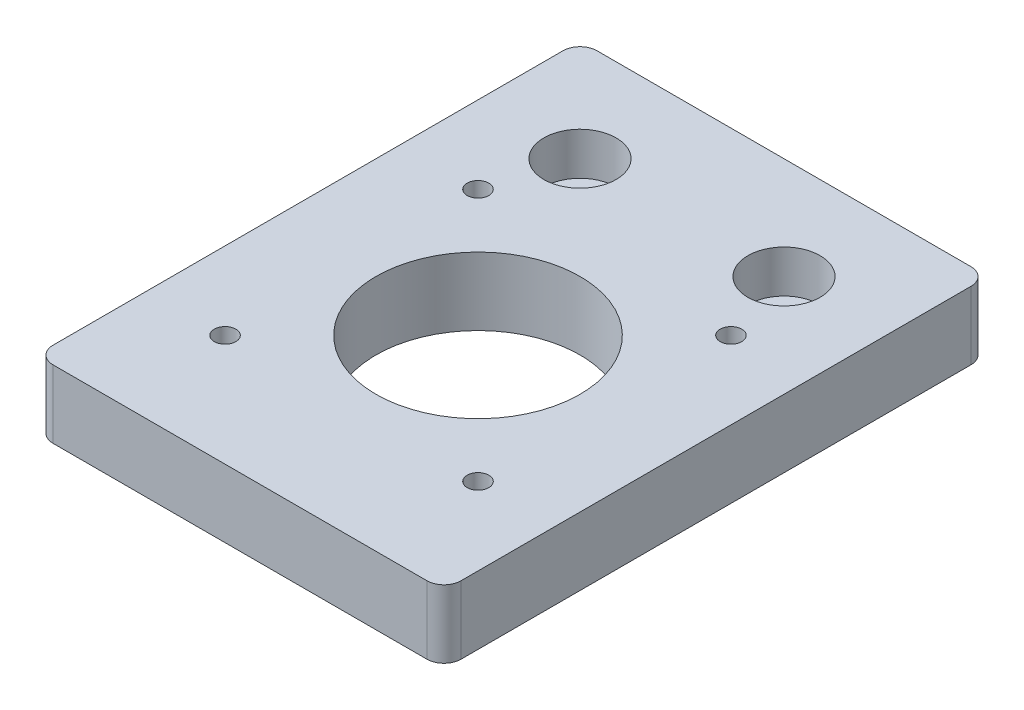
ISO-10303-21;
HEADER;
FILE_DESCRIPTION(('STEP AP214'),'2;1');
FILE_NAME('part.step','',(''),(''),'','','');
FILE_SCHEMA(('AUTOMOTIVE_DESIGN { 1 0 10303 214 1 1 1 1 }'));
ENDSEC;
DATA;
#1=APPLICATION_CONTEXT('core data for automotive mechanical design processes');
#2=APPLICATION_PROTOCOL_DEFINITION('international standard','automotive_design',2000,#1);
#3=PRODUCT_CONTEXT('',#1,'mechanical');
#4=PRODUCT('Part','Part','',(#3));
#5=PRODUCT_RELATED_PRODUCT_CATEGORY('part','',(#4));
#6=PRODUCT_DEFINITION_FORMATION('','',#4);
#7=PRODUCT_DEFINITION_CONTEXT('part definition',#1,'design');
#8=PRODUCT_DEFINITION('design','',#6,#7);
#9=PRODUCT_DEFINITION_SHAPE('','',#8);
#10=(LENGTH_UNIT() NAMED_UNIT(*) SI_UNIT(.MILLI.,.METRE.));
#11=(NAMED_UNIT(*) PLANE_ANGLE_UNIT() SI_UNIT($,.RADIAN.));
#12=(NAMED_UNIT(*) SI_UNIT($,.STERADIAN.) SOLID_ANGLE_UNIT());
#13=UNCERTAINTY_MEASURE_WITH_UNIT(LENGTH_MEASURE(1.E-05),#10,'distance_accuracy_value','');
#14=(GEOMETRIC_REPRESENTATION_CONTEXT(3) GLOBAL_UNCERTAINTY_ASSIGNED_CONTEXT((#13)) GLOBAL_UNIT_ASSIGNED_CONTEXT((#10,
#11,#12)) REPRESENTATION_CONTEXT('',''));
#15=CARTESIAN_POINT('',(0.,0.,0.));
#16=DIRECTION('',(0.,0.,1.));
#17=DIRECTION('',(1.,0.,0.));
#18=AXIS2_PLACEMENT_3D('',#15,#16,#17);
#19=CARTESIAN_POINT('',(0.,0.,-101.6));
#20=DIRECTION('',(0.,-1.,0.));
#21=DIRECTION('',(0.,0.,-1.));
#22=AXIS2_PLACEMENT_3D('',#19,#20,#21);
#23=PLANE('',#22);
#24=CARTESIAN_POINT('',(14.478,0.,-20.828));
#25=DIRECTION('',(0.,1.,0.));
#26=DIRECTION('',(0.,0.,1.));
#27=AXIS2_PLACEMENT_3D('',#24,#25,#26);
#28=CIRCLE('',#27,2.0193);
#29=CARTESIAN_POINT('',(14.478,0.,-18.8087));
#30=VERTEX_POINT('',#29);
#31=EDGE_CURVE('E216',#30,#30,#28,.T.);
#32=ORIENTED_EDGE('',*,*,#31,.T.);
#33=EDGE_LOOP('',(#32));
#34=FACE_BOUND('',#33,.T.);
#35=CARTESIAN_POINT('',(61.722,0.,-68.072));
#36=DIRECTION('',(0.,1.,0.));
#37=DIRECTION('',(0.,0.,1.));
#38=AXIS2_PLACEMENT_3D('',#35,#36,#37);
#39=CIRCLE('',#38,2.01929999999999);
#40=CARTESIAN_POINT('',(61.722,0.,-66.0527));
#41=VERTEX_POINT('',#40);
#42=EDGE_CURVE('E204',#41,#41,#39,.T.);
#43=ORIENTED_EDGE('',*,*,#42,.T.);
#44=EDGE_LOOP('',(#43));
#45=FACE_BOUND('',#44,.T.);
#46=CARTESIAN_POINT('',(19.05,0.,-82.55));
#47=DIRECTION('',(0.,1.,0.));
#48=DIRECTION('',(0.,0.,1.));
#49=AXIS2_PLACEMENT_3D('',#46,#47,#48);
#50=CIRCLE('',#49,4.1021);
#51=CARTESIAN_POINT('',(19.05,0.,-78.4479));
#52=VERTEX_POINT('',#51);
#53=EDGE_CURVE('E186',#52,#52,#50,.T.);
#54=ORIENTED_EDGE('',*,*,#53,.T.);
#55=EDGE_LOOP('',(#54));
#56=FACE_BOUND('',#55,.T.);
#57=CARTESIAN_POINT('',(38.1,0.,-44.45));
#58=DIRECTION('',(0.,1.,0.));
#59=DIRECTION('',(0.,0.,1.));
#60=AXIS2_PLACEMENT_3D('',#57,#58,#59);
#61=CIRCLE('',#60,19.0627);
#62=CARTESIAN_POINT('',(38.1,0.,-25.3873));
#63=VERTEX_POINT('',#62);
#64=EDGE_CURVE('E164',#63,#63,#61,.T.);
#65=ORIENTED_EDGE('',*,*,#64,.T.);
#66=EDGE_LOOP('',(#65));
#67=FACE_BOUND('',#66,.T.);
#68=DIRECTION('',(-1.,0.,0.));
#69=VECTOR('',#68,1.);
#70=CARTESIAN_POINT('',(0.,0.,-101.6));
#71=LINE('',#70,#69);
#72=CARTESIAN_POINT('',(73.025,0.,-101.6));
#73=VERTEX_POINT('',#72);
#74=CARTESIAN_POINT('',(3.175,0.,-101.6));
#75=VERTEX_POINT('',#74);
#76=EDGE_CURVE('E117',#73,#75,#71,.T.);
#77=ORIENTED_EDGE('',*,*,#76,.F.);
#78=CARTESIAN_POINT('',(73.025,0.,-98.425));
#79=DIRECTION('',(0.,-1.,0.));
#80=DIRECTION('',(0.,0.,-1.));
#81=AXIS2_PLACEMENT_3D('',#78,#79,#80);
#82=CIRCLE('',#81,3.175);
#83=CARTESIAN_POINT('',(76.2,0.,-98.425));
#84=VERTEX_POINT('',#83);
#85=EDGE_CURVE('E100',#73,#84,#82,.T.);
#86=ORIENTED_EDGE('',*,*,#85,.T.);
#87=DIRECTION('',(0.,0.,-1.));
#88=VECTOR('',#87,1.);
#89=CARTESIAN_POINT('',(76.2,0.,0.));
#90=LINE('',#89,#88);
#91=CARTESIAN_POINT('',(76.2,0.,-3.175));
#92=VERTEX_POINT('',#91);
#93=EDGE_CURVE('E127',#92,#84,#90,.T.);
#94=ORIENTED_EDGE('',*,*,#93,.F.);
#95=CARTESIAN_POINT('',(73.025,0.,-3.175));
#96=DIRECTION('',(0.,-1.,0.));
#97=DIRECTION('',(0.,0.,-1.));
#98=AXIS2_PLACEMENT_3D('',#95,#96,#97);
#99=CIRCLE('',#98,3.175);
#100=CARTESIAN_POINT('',(73.025,0.,0.));
#101=VERTEX_POINT('',#100);
#102=EDGE_CURVE('E121',#92,#101,#99,.T.);
#103=ORIENTED_EDGE('',*,*,#102,.T.);
#104=DIRECTION('',(1.,0.,0.));
#105=VECTOR('',#104,1.);
#106=CARTESIAN_POINT('',(0.,0.,0.));
#107=LINE('',#106,#105);
#108=CARTESIAN_POINT('',(3.175,0.,0.));
#109=VERTEX_POINT('',#108);
#110=EDGE_CURVE('E131',#109,#101,#107,.T.);
#111=ORIENTED_EDGE('',*,*,#110,.F.);
#112=CARTESIAN_POINT('',(3.175,0.,-3.175));
#113=DIRECTION('',(0.,-1.,0.));
#114=DIRECTION('',(0.,0.,-1.));
#115=AXIS2_PLACEMENT_3D('',#112,#113,#114);
#116=CIRCLE('',#115,3.175);
#117=CARTESIAN_POINT('',(0.,0.,-3.175));
#118=VERTEX_POINT('',#117);
#119=EDGE_CURVE('E137',#109,#118,#116,.T.);
#120=ORIENTED_EDGE('',*,*,#119,.T.);
#121=DIRECTION('',(0.,0.,1.));
#122=VECTOR('',#121,1.);
#123=CARTESIAN_POINT('',(0.,0.,0.));
#124=LINE('',#123,#122);
#125=CARTESIAN_POINT('',(0.,0.,-98.425));
#126=VERTEX_POINT('',#125);
#127=EDGE_CURVE('E159',#126,#118,#124,.T.);
#128=ORIENTED_EDGE('',*,*,#127,.F.);
#129=CARTESIAN_POINT('',(3.175,0.,-98.425));
#130=DIRECTION('',(0.,-1.,0.));
#131=DIRECTION('',(0.,0.,-1.));
#132=AXIS2_PLACEMENT_3D('',#129,#130,#131);
#133=CIRCLE('',#132,3.175);
#134=EDGE_CURVE('E111',#126,#75,#133,.T.);
#135=ORIENTED_EDGE('',*,*,#134,.T.);
#136=EDGE_LOOP('',(#77,#86,#94,#103,#111,#120,#128,#135));
#137=FACE_BOUND('',#136,.T.);
#138=CARTESIAN_POINT('',(57.15,0.,-82.55));
#139=DIRECTION('',(0.,1.,0.));
#140=DIRECTION('',(0.,0.,1.));
#141=AXIS2_PLACEMENT_3D('',#138,#139,#140);
#142=CIRCLE('',#141,4.1021);
#143=CARTESIAN_POINT('',(57.15,0.,-78.4479));
#144=VERTEX_POINT('',#143);
#145=EDGE_CURVE('E198',#144,#144,#142,.T.);
#146=ORIENTED_EDGE('',*,*,#145,.T.);
#147=EDGE_LOOP('',(#146));
#148=FACE_BOUND('',#147,.T.);
#149=CARTESIAN_POINT('',(14.478,0.,-68.072));
#150=DIRECTION('',(0.,1.,0.));
#151=DIRECTION('',(0.,0.,1.));
#152=AXIS2_PLACEMENT_3D('',#149,#150,#151);
#153=CIRCLE('',#152,2.0193);
#154=CARTESIAN_POINT('',(14.478,0.,-66.0527));
#155=VERTEX_POINT('',#154);
#156=EDGE_CURVE('E210',#155,#155,#153,.T.);
#157=ORIENTED_EDGE('',*,*,#156,.T.);
#158=EDGE_LOOP('',(#157));
#159=FACE_BOUND('',#158,.T.);
#160=CARTESIAN_POINT('',(61.722,0.,-20.828));
#161=DIRECTION('',(0.,1.,0.));
#162=DIRECTION('',(0.,0.,1.));
#163=AXIS2_PLACEMENT_3D('',#160,#161,#162);
#164=CIRCLE('',#163,2.0193);
#165=CARTESIAN_POINT('',(61.722,0.,-18.8087));
#166=VERTEX_POINT('',#165);
#167=EDGE_CURVE('E222',#166,#166,#164,.T.);
#168=ORIENTED_EDGE('',*,*,#167,.T.);
#169=EDGE_LOOP('',(#168));
#170=FACE_BOUND('',#169,.T.);
#171=ADVANCED_FACE('F34',(#34,#45,#56,#67,#137,#148,#159,#170),#23,.T.);
#172=CARTESIAN_POINT('',(0.,12.7,0.));
#173=DIRECTION('',(1.,0.,0.));
#174=DIRECTION('',(0.,0.,-1.));
#175=AXIS2_PLACEMENT_3D('',#172,#173,#174);
#176=PLANE('',#175);
#177=DIRECTION('',(0.,0.,1.));
#178=VECTOR('',#177,1.);
#179=CARTESIAN_POINT('',(0.,12.7,0.));
#180=LINE('',#179,#178);
#181=CARTESIAN_POINT('',(0.,12.7,-98.425));
#182=VERTEX_POINT('',#181);
#183=CARTESIAN_POINT('',(0.,12.7,-3.175));
#184=VERTEX_POINT('',#183);
#185=EDGE_CURVE('E126',#182,#184,#180,.T.);
#186=ORIENTED_EDGE('',*,*,#185,.F.);
#187=DIRECTION('',(0.,-1.,0.));
#188=VECTOR('',#187,1.);
#189=CARTESIAN_POINT('',(0.,12.7,-98.425));
#190=LINE('',#189,#188);
#191=EDGE_CURVE('E152',#182,#126,#190,.T.);
#192=ORIENTED_EDGE('',*,*,#191,.T.);
#193=ORIENTED_EDGE('',*,*,#127,.T.);
#194=DIRECTION('',(0.,-1.,0.));
#195=VECTOR('',#194,1.);
#196=CARTESIAN_POINT('',(0.,12.7,-3.175));
#197=LINE('',#196,#195);
#198=EDGE_CURVE('E150',#118,#184,#197,.F.);
#199=ORIENTED_EDGE('',*,*,#198,.T.);
#200=EDGE_LOOP('',(#186,#192,#193,#199));
#201=FACE_BOUND('',#200,.T.);
#202=ADVANCED_FACE('F158',(#201),#176,.F.);
#203=CARTESIAN_POINT('',(0.,12.7,0.));
#204=DIRECTION('',(0.,0.,-1.));
#205=DIRECTION('',(-1.,0.,0.));
#206=AXIS2_PLACEMENT_3D('',#203,#204,#205);
#207=PLANE('',#206);
#208=DIRECTION('',(1.,0.,0.));
#209=VECTOR('',#208,1.);
#210=CARTESIAN_POINT('',(0.,12.7,0.));
#211=LINE('',#210,#209);
#212=CARTESIAN_POINT('',(3.175,12.7,0.));
#213=VERTEX_POINT('',#212);
#214=CARTESIAN_POINT('',(73.025,12.7,0.));
#215=VERTEX_POINT('',#214);
#216=EDGE_CURVE('E129',#213,#215,#211,.T.);
#217=ORIENTED_EDGE('',*,*,#216,.F.);
#218=DIRECTION('',(0.,-1.,0.));
#219=VECTOR('',#218,1.);
#220=CARTESIAN_POINT('',(3.175,12.7,0.));
#221=LINE('',#220,#219);
#222=EDGE_CURVE('E11',#213,#109,#221,.T.);
#223=ORIENTED_EDGE('',*,*,#222,.T.);
#224=ORIENTED_EDGE('',*,*,#110,.T.);
#225=DIRECTION('',(0.,-1.,0.));
#226=VECTOR('',#225,1.);
#227=CARTESIAN_POINT('',(73.025,12.7,0.));
#228=LINE('',#227,#226);
#229=EDGE_CURVE('E42',#101,#215,#228,.F.);
#230=ORIENTED_EDGE('',*,*,#229,.T.);
#231=EDGE_LOOP('',(#217,#223,#224,#230));
#232=FACE_BOUND('',#231,.T.);
#233=ADVANCED_FACE('F256',(#232),#207,.F.);
#234=CARTESIAN_POINT('',(76.2,12.7,0.));
#235=DIRECTION('',(-1.,0.,0.));
#236=DIRECTION('',(0.,0.,1.));
#237=AXIS2_PLACEMENT_3D('',#234,#235,#236);
#238=PLANE('',#237);
#239=ORIENTED_EDGE('',*,*,#93,.T.);
#240=DIRECTION('',(0.,-1.,0.));
#241=VECTOR('',#240,1.);
#242=CARTESIAN_POINT('',(76.2,12.7,-98.425));
#243=LINE('',#242,#241);
#244=CARTESIAN_POINT('',(76.2,12.7,-98.425));
#245=VERTEX_POINT('',#244);
#246=EDGE_CURVE('E105',#84,#245,#243,.F.);
#247=ORIENTED_EDGE('',*,*,#246,.T.);
#248=DIRECTION('',(0.,0.,-1.));
#249=VECTOR('',#248,1.);
#250=CARTESIAN_POINT('',(76.2,12.7,0.));
#251=LINE('',#250,#249);
#252=CARTESIAN_POINT('',(76.2,12.7,-3.175));
#253=VERTEX_POINT('',#252);
#254=EDGE_CURVE('E171',#253,#245,#251,.T.);
#255=ORIENTED_EDGE('',*,*,#254,.F.);
#256=DIRECTION('',(0.,-1.,0.));
#257=VECTOR('',#256,1.);
#258=CARTESIAN_POINT('',(76.2,12.7,-3.175));
#259=LINE('',#258,#257);
#260=EDGE_CURVE('E110',#253,#92,#259,.T.);
#261=ORIENTED_EDGE('',*,*,#260,.T.);
#262=EDGE_LOOP('',(#239,#247,#255,#261));
#263=FACE_BOUND('',#262,.T.);
#264=ADVANCED_FACE('F254',(#263),#238,.F.);
#265=CARTESIAN_POINT('',(0.,12.7,-101.6));
#266=DIRECTION('',(0.,0.,1.));
#267=DIRECTION('',(1.,0.,0.));
#268=AXIS2_PLACEMENT_3D('',#265,#266,#267);
#269=PLANE('',#268);
#270=DIRECTION('',(-1.,0.,0.));
#271=VECTOR('',#270,1.);
#272=CARTESIAN_POINT('',(0.,12.7,-101.6));
#273=LINE('',#272,#271);
#274=CARTESIAN_POINT('',(73.025,12.7,-101.6));
#275=VERTEX_POINT('',#274);
#276=CARTESIAN_POINT('',(3.175,12.7,-101.6));
#277=VERTEX_POINT('',#276);
#278=EDGE_CURVE('E120',#275,#277,#273,.T.);
#279=ORIENTED_EDGE('',*,*,#278,.F.);
#280=DIRECTION('',(0.,-1.,0.));
#281=VECTOR('',#280,1.);
#282=CARTESIAN_POINT('',(73.025,12.7,-101.6));
#283=LINE('',#282,#281);
#284=EDGE_CURVE('E104',#275,#73,#283,.T.);
#285=ORIENTED_EDGE('',*,*,#284,.T.);
#286=ORIENTED_EDGE('',*,*,#76,.T.);
#287=DIRECTION('',(0.,-1.,0.));
#288=VECTOR('',#287,1.);
#289=CARTESIAN_POINT('',(3.175,12.7,-101.6));
#290=LINE('',#289,#288);
#291=EDGE_CURVE('E122',#75,#277,#290,.F.);
#292=ORIENTED_EDGE('',*,*,#291,.T.);
#293=EDGE_LOOP('',(#279,#285,#286,#292));
#294=FACE_BOUND('',#293,.T.);
#295=ADVANCED_FACE('F116',(#294),#269,.F.);
#296=CARTESIAN_POINT('',(0.,12.7,-101.6));
#297=DIRECTION('',(0.,-1.,0.));
#298=DIRECTION('',(0.,0.,-1.));
#299=AXIS2_PLACEMENT_3D('',#296,#297,#298);
#300=PLANE('',#299);
#301=CARTESIAN_POINT('',(61.722,12.7,-20.828));
#302=DIRECTION('',(0.,1.,0.));
#303=DIRECTION('',(0.,0.,1.));
#304=AXIS2_PLACEMENT_3D('',#301,#302,#303);
#305=CIRCLE('',#304,2.0193);
#306=CARTESIAN_POINT('',(61.722,12.7,-18.8087));
#307=VERTEX_POINT('',#306);
#308=EDGE_CURVE('E219',#307,#307,#305,.T.);
#309=ORIENTED_EDGE('',*,*,#308,.F.);
#310=EDGE_LOOP('',(#309));
#311=FACE_BOUND('',#310,.T.);
#312=CARTESIAN_POINT('',(14.478,12.7,-20.828));
#313=DIRECTION('',(0.,1.,0.));
#314=DIRECTION('',(0.,0.,1.));
#315=AXIS2_PLACEMENT_3D('',#312,#313,#314);
#316=CIRCLE('',#315,2.0193);
#317=CARTESIAN_POINT('',(14.478,12.7,-18.8087));
#318=VERTEX_POINT('',#317);
#319=EDGE_CURVE('E213',#318,#318,#316,.T.);
#320=ORIENTED_EDGE('',*,*,#319,.F.);
#321=EDGE_LOOP('',(#320));
#322=FACE_BOUND('',#321,.T.);
#323=CARTESIAN_POINT('',(14.478,12.7,-68.072));
#324=DIRECTION('',(0.,1.,0.));
#325=DIRECTION('',(0.,0.,1.));
#326=AXIS2_PLACEMENT_3D('',#323,#324,#325);
#327=CIRCLE('',#326,2.0193);
#328=CARTESIAN_POINT('',(14.478,12.7,-66.0527));
#329=VERTEX_POINT('',#328);
#330=EDGE_CURVE('E207',#329,#329,#327,.T.);
#331=ORIENTED_EDGE('',*,*,#330,.F.);
#332=EDGE_LOOP('',(#331));
#333=FACE_BOUND('',#332,.T.);
#334=CARTESIAN_POINT('',(61.722,12.7,-68.072));
#335=DIRECTION('',(0.,1.,0.));
#336=DIRECTION('',(0.,0.,1.));
#337=AXIS2_PLACEMENT_3D('',#334,#335,#336);
#338=CIRCLE('',#337,2.01929999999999);
#339=CARTESIAN_POINT('',(61.722,12.7,-66.0527));
#340=VERTEX_POINT('',#339);
#341=EDGE_CURVE('E201',#340,#340,#338,.T.);
#342=ORIENTED_EDGE('',*,*,#341,.F.);
#343=EDGE_LOOP('',(#342));
#344=FACE_BOUND('',#343,.T.);
#345=CARTESIAN_POINT('',(57.15,12.7,-82.55));
#346=DIRECTION('',(0.,1.,0.));
#347=DIRECTION('',(0.,0.,1.));
#348=AXIS2_PLACEMENT_3D('',#345,#346,#347);
#349=CIRCLE('',#348,6.74751000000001);
#350=CARTESIAN_POINT('',(57.15,12.7,-75.80249));
#351=VERTEX_POINT('',#350);
#352=EDGE_CURVE('E189',#351,#351,#349,.T.);
#353=ORIENTED_EDGE('',*,*,#352,.F.);
#354=EDGE_LOOP('',(#353));
#355=FACE_BOUND('',#354,.T.);
#356=CARTESIAN_POINT('',(19.05,12.7,-82.55));
#357=DIRECTION('',(0.,1.,0.));
#358=DIRECTION('',(0.,0.,1.));
#359=AXIS2_PLACEMENT_3D('',#356,#357,#358);
#360=CIRCLE('',#359,6.74751);
#361=CARTESIAN_POINT('',(19.05,12.7,-75.80249));
#362=VERTEX_POINT('',#361);
#363=EDGE_CURVE('E176',#362,#362,#360,.T.);
#364=ORIENTED_EDGE('',*,*,#363,.F.);
#365=EDGE_LOOP('',(#364));
#366=FACE_BOUND('',#365,.T.);
#367=CARTESIAN_POINT('',(38.1,12.7,-44.45));
#368=DIRECTION('',(0.,1.,0.));
#369=DIRECTION('',(0.,0.,1.));
#370=AXIS2_PLACEMENT_3D('',#367,#368,#369);
#371=CIRCLE('',#370,19.0627);
#372=CARTESIAN_POINT('',(38.1,12.7,-25.3873));
#373=VERTEX_POINT('',#372);
#374=EDGE_CURVE('E167',#373,#373,#371,.T.);
#375=ORIENTED_EDGE('',*,*,#374,.F.);
#376=EDGE_LOOP('',(#375));
#377=FACE_BOUND('',#376,.T.);
#378=ORIENTED_EDGE('',*,*,#254,.T.);
#379=CARTESIAN_POINT('',(73.025,12.7,-98.425));
#380=DIRECTION('',(0.,-1.,0.));
#381=DIRECTION('',(0.,0.,-1.));
#382=AXIS2_PLACEMENT_3D('',#379,#380,#381);
#383=CIRCLE('',#382,3.175);
#384=EDGE_CURVE('E148',#245,#275,#383,.F.);
#385=ORIENTED_EDGE('',*,*,#384,.T.);
#386=ORIENTED_EDGE('',*,*,#278,.T.);
#387=CARTESIAN_POINT('',(3.175,12.7,-98.425));
#388=DIRECTION('',(0.,-1.,0.));
#389=DIRECTION('',(0.,0.,-1.));
#390=AXIS2_PLACEMENT_3D('',#387,#388,#389);
#391=CIRCLE('',#390,3.175);
#392=EDGE_CURVE('E146',#277,#182,#391,.F.);
#393=ORIENTED_EDGE('',*,*,#392,.T.);
#394=ORIENTED_EDGE('',*,*,#185,.T.);
#395=CARTESIAN_POINT('',(3.175,12.7,-3.175));
#396=DIRECTION('',(0.,-1.,0.));
#397=DIRECTION('',(0.,0.,-1.));
#398=AXIS2_PLACEMENT_3D('',#395,#396,#397);
#399=CIRCLE('',#398,3.175);
#400=EDGE_CURVE('E55',#184,#213,#399,.F.);
#401=ORIENTED_EDGE('',*,*,#400,.T.);
#402=ORIENTED_EDGE('',*,*,#216,.T.);
#403=CARTESIAN_POINT('',(73.025,12.7,-3.175));
#404=DIRECTION('',(0.,-1.,0.));
#405=DIRECTION('',(0.,0.,-1.));
#406=AXIS2_PLACEMENT_3D('',#403,#404,#405);
#407=CIRCLE('',#406,3.175);
#408=EDGE_CURVE('E143',#215,#253,#407,.F.);
#409=ORIENTED_EDGE('',*,*,#408,.T.);
#410=EDGE_LOOP('',(#378,#385,#386,#393,#394,#401,#402,#409));
#411=FACE_BOUND('',#410,.T.);
#412=ADVANCED_FACE('F234',(#311,#322,#333,#344,#355,#366,#377,#411),#300,.F.);
#413=CARTESIAN_POINT('',(38.1,0.,-44.45));
#414=DIRECTION('',(0.,1.,0.));
#415=DIRECTION('',(0.,0.,1.));
#416=AXIS2_PLACEMENT_3D('',#413,#414,#415);
#417=CYLINDRICAL_SURFACE('',#416,19.0627);
#418=ORIENTED_EDGE('',*,*,#64,.F.);
#419=EDGE_LOOP('',(#418));
#420=FACE_BOUND('',#419,.T.);
#421=ORIENTED_EDGE('',*,*,#374,.T.);
#422=EDGE_LOOP('',(#421));
#423=FACE_BOUND('',#422,.T.);
#424=ADVANCED_FACE('F237',(#420,#423),#417,.F.);
#425=CARTESIAN_POINT('',(19.05,12.7,-82.55));
#426=DIRECTION('',(0.,1.,0.));
#427=DIRECTION('',(0.,0.,1.));
#428=AXIS2_PLACEMENT_3D('',#425,#426,#427);
#429=CYLINDRICAL_SURFACE('',#428,6.74751);
#430=CARTESIAN_POINT('',(19.05,4.7625,-82.55));
#431=DIRECTION('',(0.,1.,0.));
#432=DIRECTION('',(0.,0.,1.));
#433=AXIS2_PLACEMENT_3D('',#430,#431,#432);
#434=CIRCLE('',#433,6.74751);
#435=CARTESIAN_POINT('',(19.05,4.7625,-75.80249));
#436=VERTEX_POINT('',#435);
#437=EDGE_CURVE('E180',#436,#436,#434,.T.);
#438=ORIENTED_EDGE('',*,*,#437,.F.);
#439=EDGE_LOOP('',(#438));
#440=FACE_BOUND('',#439,.T.);
#441=ORIENTED_EDGE('',*,*,#363,.T.);
#442=EDGE_LOOP('',(#441));
#443=FACE_BOUND('',#442,.T.);
#444=ADVANCED_FACE('F306',(#440,#443),#429,.F.);
#445=CARTESIAN_POINT('',(23.1521,4.7625,-82.55));
#446=DIRECTION('',(0.,-1.,0.));
#447=DIRECTION('',(0.,0.,-1.));
#448=AXIS2_PLACEMENT_3D('',#445,#446,#447);
#449=PLANE('',#448);
#450=CARTESIAN_POINT('',(19.05,4.7625,-82.55));
#451=DIRECTION('',(0.,1.,0.));
#452=DIRECTION('',(0.,0.,1.));
#453=AXIS2_PLACEMENT_3D('',#450,#451,#452);
#454=CIRCLE('',#453,4.1021);
#455=CARTESIAN_POINT('',(19.05,4.7625,-78.4479));
#456=VERTEX_POINT('',#455);
#457=EDGE_CURVE('E183',#456,#456,#454,.T.);
#458=ORIENTED_EDGE('',*,*,#457,.F.);
#459=EDGE_LOOP('',(#458));
#460=FACE_BOUND('',#459,.T.);
#461=ORIENTED_EDGE('',*,*,#437,.T.);
#462=EDGE_LOOP('',(#461));
#463=FACE_BOUND('',#462,.T.);
#464=ADVANCED_FACE('F313',(#460,#463),#449,.F.);
#465=CARTESIAN_POINT('',(19.05,12.7,-82.55));
#466=DIRECTION('',(0.,1.,0.));
#467=DIRECTION('',(0.,0.,1.));
#468=AXIS2_PLACEMENT_3D('',#465,#466,#467);
#469=CYLINDRICAL_SURFACE('',#468,4.1021);
#470=ORIENTED_EDGE('',*,*,#53,.F.);
#471=EDGE_LOOP('',(#470));
#472=FACE_BOUND('',#471,.T.);
#473=ORIENTED_EDGE('',*,*,#457,.T.);
#474=EDGE_LOOP('',(#473));
#475=FACE_BOUND('',#474,.T.);
#476=ADVANCED_FACE('F321',(#472,#475),#469,.F.);
#477=CARTESIAN_POINT('',(57.15,12.7,-82.55));
#478=DIRECTION('',(0.,1.,0.));
#479=DIRECTION('',(0.,0.,1.));
#480=AXIS2_PLACEMENT_3D('',#477,#478,#479);
#481=CYLINDRICAL_SURFACE('',#480,6.74751);
#482=CARTESIAN_POINT('',(57.15,4.7625,-82.55));
#483=DIRECTION('',(0.,1.,0.));
#484=DIRECTION('',(0.,0.,1.));
#485=AXIS2_PLACEMENT_3D('',#482,#483,#484);
#486=CIRCLE('',#485,6.74750999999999);
#487=CARTESIAN_POINT('',(57.15,4.7625,-75.80249));
#488=VERTEX_POINT('',#487);
#489=EDGE_CURVE('E192',#488,#488,#486,.T.);
#490=ORIENTED_EDGE('',*,*,#489,.F.);
#491=EDGE_LOOP('',(#490));
#492=FACE_BOUND('',#491,.T.);
#493=ORIENTED_EDGE('',*,*,#352,.T.);
#494=EDGE_LOOP('',(#493));
#495=FACE_BOUND('',#494,.T.);
#496=ADVANCED_FACE('F329',(#492,#495),#481,.F.);
#497=CARTESIAN_POINT('',(61.2521,4.7625,-82.55));
#498=DIRECTION('',(0.,-1.,0.));
#499=DIRECTION('',(0.,0.,-1.));
#500=AXIS2_PLACEMENT_3D('',#497,#498,#499);
#501=PLANE('',#500);
#502=CARTESIAN_POINT('',(57.15,4.7625,-82.55));
#503=DIRECTION('',(0.,1.,0.));
#504=DIRECTION('',(0.,0.,1.));
#505=AXIS2_PLACEMENT_3D('',#502,#503,#504);
#506=CIRCLE('',#505,4.1021);
#507=CARTESIAN_POINT('',(57.15,4.7625,-78.4479));
#508=VERTEX_POINT('',#507);
#509=EDGE_CURVE('E195',#508,#508,#506,.T.);
#510=ORIENTED_EDGE('',*,*,#509,.F.);
#511=EDGE_LOOP('',(#510));
#512=FACE_BOUND('',#511,.T.);
#513=ORIENTED_EDGE('',*,*,#489,.T.);
#514=EDGE_LOOP('',(#513));
#515=FACE_BOUND('',#514,.T.);
#516=ADVANCED_FACE('F337',(#512,#515),#501,.F.);
#517=CARTESIAN_POINT('',(57.15,12.7,-82.55));
#518=DIRECTION('',(0.,1.,0.));
#519=DIRECTION('',(0.,0.,1.));
#520=AXIS2_PLACEMENT_3D('',#517,#518,#519);
#521=CYLINDRICAL_SURFACE('',#520,4.1021);
#522=ORIENTED_EDGE('',*,*,#145,.F.);
#523=EDGE_LOOP('',(#522));
#524=FACE_BOUND('',#523,.T.);
#525=ORIENTED_EDGE('',*,*,#509,.T.);
#526=EDGE_LOOP('',(#525));
#527=FACE_BOUND('',#526,.T.);
#528=ADVANCED_FACE('F345',(#524,#527),#521,.F.);
#529=CARTESIAN_POINT('',(61.722,12.7,-68.072));
#530=DIRECTION('',(0.,1.,0.));
#531=DIRECTION('',(0.,0.,1.));
#532=AXIS2_PLACEMENT_3D('',#529,#530,#531);
#533=CYLINDRICAL_SURFACE('',#532,2.01929999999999);
#534=ORIENTED_EDGE('',*,*,#42,.F.);
#535=EDGE_LOOP('',(#534));
#536=FACE_BOUND('',#535,.T.);
#537=ORIENTED_EDGE('',*,*,#341,.T.);
#538=EDGE_LOOP('',(#537));
#539=FACE_BOUND('',#538,.T.);
#540=ADVANCED_FACE('F353',(#536,#539),#533,.F.);
#541=CARTESIAN_POINT('',(14.478,12.7,-68.072));
#542=DIRECTION('',(0.,1.,0.));
#543=DIRECTION('',(0.,0.,1.));
#544=AXIS2_PLACEMENT_3D('',#541,#542,#543);
#545=CYLINDRICAL_SURFACE('',#544,2.0193);
#546=ORIENTED_EDGE('',*,*,#156,.F.);
#547=EDGE_LOOP('',(#546));
#548=FACE_BOUND('',#547,.T.);
#549=ORIENTED_EDGE('',*,*,#330,.T.);
#550=EDGE_LOOP('',(#549));
#551=FACE_BOUND('',#550,.T.);
#552=ADVANCED_FACE('F362',(#548,#551),#545,.F.);
#553=CARTESIAN_POINT('',(14.478,12.7,-20.828));
#554=DIRECTION('',(0.,1.,0.));
#555=DIRECTION('',(0.,0.,1.));
#556=AXIS2_PLACEMENT_3D('',#553,#554,#555);
#557=CYLINDRICAL_SURFACE('',#556,2.0193);
#558=ORIENTED_EDGE('',*,*,#31,.F.);
#559=EDGE_LOOP('',(#558));
#560=FACE_BOUND('',#559,.T.);
#561=ORIENTED_EDGE('',*,*,#319,.T.);
#562=EDGE_LOOP('',(#561));
#563=FACE_BOUND('',#562,.T.);
#564=ADVANCED_FACE('F230',(#560,#563),#557,.F.);
#565=CARTESIAN_POINT('',(61.722,12.7,-20.828));
#566=DIRECTION('',(0.,1.,0.));
#567=DIRECTION('',(0.,0.,1.));
#568=AXIS2_PLACEMENT_3D('',#565,#566,#567);
#569=CYLINDRICAL_SURFACE('',#568,2.0193);
#570=ORIENTED_EDGE('',*,*,#167,.F.);
#571=EDGE_LOOP('',(#570));
#572=FACE_BOUND('',#571,.T.);
#573=ORIENTED_EDGE('',*,*,#308,.T.);
#574=EDGE_LOOP('',(#573));
#575=FACE_BOUND('',#574,.T.);
#576=ADVANCED_FACE('F227',(#572,#575),#569,.F.);
#577=CARTESIAN_POINT('',(73.025,12.7,-98.425));
#578=DIRECTION('',(0.,-1.,0.));
#579=DIRECTION('',(0.,0.,-1.));
#580=AXIS2_PLACEMENT_3D('',#577,#578,#579);
#581=CYLINDRICAL_SURFACE('',#580,3.175);
#582=ORIENTED_EDGE('',*,*,#384,.F.);
#583=ORIENTED_EDGE('',*,*,#246,.F.);
#584=ORIENTED_EDGE('',*,*,#85,.F.);
#585=ORIENTED_EDGE('',*,*,#284,.F.);
#586=EDGE_LOOP('',(#582,#583,#584,#585));
#587=FACE_BOUND('',#586,.T.);
#588=ADVANCED_FACE('F103',(#587),#581,.T.);
#589=CARTESIAN_POINT('',(3.175,12.7,-98.425));
#590=DIRECTION('',(0.,-1.,0.));
#591=DIRECTION('',(0.,0.,-1.));
#592=AXIS2_PLACEMENT_3D('',#589,#590,#591);
#593=CYLINDRICAL_SURFACE('',#592,3.175);
#594=ORIENTED_EDGE('',*,*,#392,.F.);
#595=ORIENTED_EDGE('',*,*,#291,.F.);
#596=ORIENTED_EDGE('',*,*,#134,.F.);
#597=ORIENTED_EDGE('',*,*,#191,.F.);
#598=EDGE_LOOP('',(#594,#595,#596,#597));
#599=FACE_BOUND('',#598,.T.);
#600=ADVANCED_FACE('F260',(#599),#593,.T.);
#601=CARTESIAN_POINT('',(3.175,12.7,-3.175));
#602=DIRECTION('',(0.,-1.,0.));
#603=DIRECTION('',(0.,0.,-1.));
#604=AXIS2_PLACEMENT_3D('',#601,#602,#603);
#605=CYLINDRICAL_SURFACE('',#604,3.175);
#606=ORIENTED_EDGE('',*,*,#400,.F.);
#607=ORIENTED_EDGE('',*,*,#198,.F.);
#608=ORIENTED_EDGE('',*,*,#119,.F.);
#609=ORIENTED_EDGE('',*,*,#222,.F.);
#610=EDGE_LOOP('',(#606,#607,#608,#609));
#611=FACE_BOUND('',#610,.T.);
#612=ADVANCED_FACE('F259',(#611),#605,.T.);
#613=CARTESIAN_POINT('',(73.025,12.7,-3.175));
#614=DIRECTION('',(0.,-1.,0.));
#615=DIRECTION('',(0.,0.,-1.));
#616=AXIS2_PLACEMENT_3D('',#613,#614,#615);
#617=CYLINDRICAL_SURFACE('',#616,3.175);
#618=ORIENTED_EDGE('',*,*,#408,.F.);
#619=ORIENTED_EDGE('',*,*,#229,.F.);
#620=ORIENTED_EDGE('',*,*,#102,.F.);
#621=ORIENTED_EDGE('',*,*,#260,.F.);
#622=EDGE_LOOP('',(#618,#619,#620,#621));
#623=FACE_BOUND('',#622,.T.);
#624=ADVANCED_FACE('F36',(#623),#617,.T.);
#625=CLOSED_SHELL('',(#171,#202,#233,#264,#295,#412,#424,#444,#464,#476,#496,#516,#528,#540,
#552,#564,#576,#588,#600,#612,#624));
#626=MANIFOLD_SOLID_BREP('B2',#625);
#627=ADVANCED_BREP_SHAPE_REPRESENTATION('',(#18,#626),#14);
#628=SHAPE_DEFINITION_REPRESENTATION(#9,#627);
ENDSEC;
END-ISO-10303-21;
